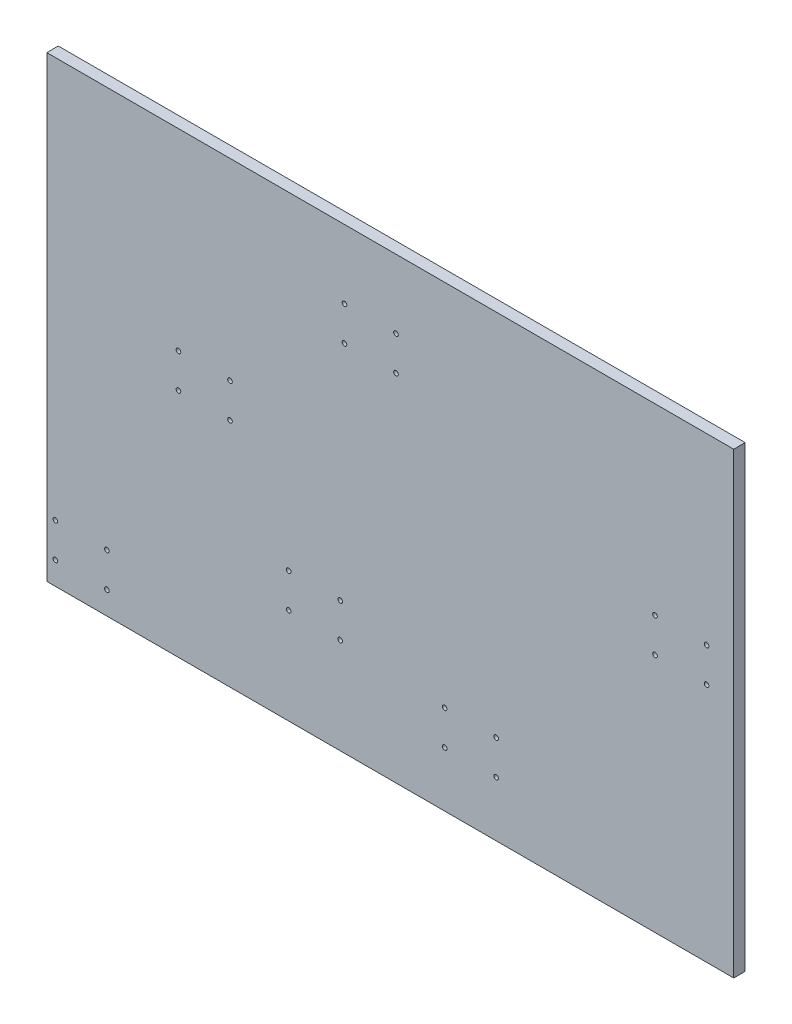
ISO-10303-21;
HEADER;
FILE_DESCRIPTION(('STEP AP214'),'2;1');
FILE_NAME('part.step','',(''),(''),'','','');
FILE_SCHEMA(('AUTOMOTIVE_DESIGN { 1 0 10303 214 1 1 1 1 }'));
ENDSEC;
DATA;
#1=APPLICATION_CONTEXT('core data for automotive mechanical design processes');
#2=APPLICATION_PROTOCOL_DEFINITION('international standard','automotive_design',2000,#1);
#3=PRODUCT_CONTEXT('',#1,'mechanical');
#4=PRODUCT('Part','Part','',(#3));
#5=PRODUCT_RELATED_PRODUCT_CATEGORY('part','',(#4));
#6=PRODUCT_DEFINITION_FORMATION('','',#4);
#7=PRODUCT_DEFINITION_CONTEXT('part definition',#1,'design');
#8=PRODUCT_DEFINITION('design','',#6,#7);
#9=PRODUCT_DEFINITION_SHAPE('','',#8);
#10=(LENGTH_UNIT() NAMED_UNIT(*) SI_UNIT(.MILLI.,.METRE.));
#11=(NAMED_UNIT(*) PLANE_ANGLE_UNIT() SI_UNIT($,.RADIAN.));
#12=(NAMED_UNIT(*) SI_UNIT($,.STERADIAN.) SOLID_ANGLE_UNIT());
#13=UNCERTAINTY_MEASURE_WITH_UNIT(LENGTH_MEASURE(1.E-05),#10,'distance_accuracy_value','');
#14=(GEOMETRIC_REPRESENTATION_CONTEXT(3) GLOBAL_UNCERTAINTY_ASSIGNED_CONTEXT((#13)) GLOBAL_UNIT_ASSIGNED_CONTEXT((#10,
#11,#12)) REPRESENTATION_CONTEXT('',''));
#15=CARTESIAN_POINT('',(0.,0.,0.));
#16=DIRECTION('',(0.,0.,1.));
#17=DIRECTION('',(1.,0.,0.));
#18=AXIS2_PLACEMENT_3D('',#15,#16,#17);
#19=CARTESIAN_POINT('',(0.,508.,0.));
#20=DIRECTION('',(0.,0.,-1.));
#21=DIRECTION('',(-1.,0.,0.));
#22=AXIS2_PLACEMENT_3D('',#19,#20,#21);
#23=PLANE('',#22);
#24=CARTESIAN_POINT('',(203.2,256.38125,0.));
#25=DIRECTION('',(0.,0.,1.));
#26=DIRECTION('',(1.,0.,0.));
#27=AXIS2_PLACEMENT_3D('',#24,#25,#26);
#28=CIRCLE('',#27,2.55269999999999);
#29=CARTESIAN_POINT('',(205.7527,256.38125,0.));
#30=VERTEX_POINT('',#29);
#31=EDGE_CURVE('E240',#30,#30,#28,.T.);
#32=ORIENTED_EDGE('',*,*,#31,.T.);
#33=EDGE_LOOP('',(#32));
#34=FACE_BOUND('',#33,.T.);
#35=CARTESIAN_POINT('',(146.05,294.48125,0.));
#36=DIRECTION('',(0.,0.,1.));
#37=DIRECTION('',(1.,0.,0.));
#38=AXIS2_PLACEMENT_3D('',#35,#36,#37);
#39=CIRCLE('',#38,2.55269999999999);
#40=CARTESIAN_POINT('',(148.6027,294.48125,0.));
#41=VERTEX_POINT('',#40);
#42=EDGE_CURVE('E228',#41,#41,#39,.T.);
#43=ORIENTED_EDGE('',*,*,#42,.T.);
#44=EDGE_LOOP('',(#43));
#45=FACE_BOUND('',#44,.T.);
#46=CARTESIAN_POINT('',(387.35,393.7,0.));
#47=DIRECTION('',(0.,0.,1.));
#48=DIRECTION('',(1.,0.,0.));
#49=AXIS2_PLACEMENT_3D('',#46,#47,#48);
#50=CIRCLE('',#49,2.55270000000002);
#51=CARTESIAN_POINT('',(389.9027,393.7,0.));
#52=VERTEX_POINT('',#51);
#53=EDGE_CURVE('E216',#52,#52,#50,.T.);
#54=ORIENTED_EDGE('',*,*,#53,.T.);
#55=EDGE_LOOP('',(#54));
#56=FACE_BOUND('',#55,.T.);
#57=CARTESIAN_POINT('',(330.2,431.8,0.));
#58=DIRECTION('',(0.,0.,1.));
#59=DIRECTION('',(1.,0.,0.));
#60=AXIS2_PLACEMENT_3D('',#57,#58,#59);
#61=CIRCLE('',#60,2.55270000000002);
#62=CARTESIAN_POINT('',(332.7527,431.8,0.));
#63=VERTEX_POINT('',#62);
#64=EDGE_CURVE('E204',#63,#63,#61,.T.);
#65=ORIENTED_EDGE('',*,*,#64,.T.);
#66=EDGE_LOOP('',(#65));
#67=FACE_BOUND('',#66,.T.);
#68=CARTESIAN_POINT('',(731.8375,266.7,0.));
#69=DIRECTION('',(0.,0.,1.));
#70=DIRECTION('',(1.,0.,0.));
#71=AXIS2_PLACEMENT_3D('',#68,#69,#70);
#72=CIRCLE('',#71,2.55269999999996);
#73=CARTESIAN_POINT('',(734.3902,266.7,0.));
#74=VERTEX_POINT('',#73);
#75=EDGE_CURVE('E192',#74,#74,#72,.T.);
#76=ORIENTED_EDGE('',*,*,#75,.T.);
#77=EDGE_LOOP('',(#76));
#78=FACE_BOUND('',#77,.T.);
#79=CARTESIAN_POINT('',(674.6875,304.8,0.));
#80=DIRECTION('',(0.,0.,1.));
#81=DIRECTION('',(1.,0.,0.));
#82=AXIS2_PLACEMENT_3D('',#79,#80,#81);
#83=CIRCLE('',#82,2.55269999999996);
#84=CARTESIAN_POINT('',(677.2402,304.8,0.));
#85=VERTEX_POINT('',#84);
#86=EDGE_CURVE('E180',#85,#85,#83,.T.);
#87=ORIENTED_EDGE('',*,*,#86,.T.);
#88=EDGE_LOOP('',(#87));
#89=FACE_BOUND('',#88,.T.);
#90=CARTESIAN_POINT('',(498.475,61.11875,0.));
#91=DIRECTION('',(0.,0.,1.));
#92=DIRECTION('',(1.,0.,0.));
#93=AXIS2_PLACEMENT_3D('',#90,#91,#92);
#94=CIRCLE('',#93,2.55270000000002);
#95=CARTESIAN_POINT('',(501.0277,61.11875,0.));
#96=VERTEX_POINT('',#95);
#97=EDGE_CURVE('E168',#96,#96,#94,.T.);
#98=ORIENTED_EDGE('',*,*,#97,.T.);
#99=EDGE_LOOP('',(#98));
#100=FACE_BOUND('',#99,.T.);
#101=CARTESIAN_POINT('',(268.2875,106.3625,0.));
#102=DIRECTION('',(0.,0.,1.));
#103=DIRECTION('',(1.,0.,0.));
#104=AXIS2_PLACEMENT_3D('',#101,#102,#103);
#105=CIRCLE('',#104,2.55270000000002);
#106=CARTESIAN_POINT('',(270.8402,106.3625,0.));
#107=VERTEX_POINT('',#106);
#108=EDGE_CURVE('E150',#107,#107,#105,.T.);
#109=ORIENTED_EDGE('',*,*,#108,.T.);
#110=EDGE_LOOP('',(#109));
#111=FACE_BOUND('',#110,.T.);
#112=CARTESIAN_POINT('',(325.4375,144.4625,0.));
#113=DIRECTION('',(0.,0.,1.));
#114=DIRECTION('',(1.,0.,0.));
#115=AXIS2_PLACEMENT_3D('',#112,#113,#114);
#116=CIRCLE('',#115,2.55270000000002);
#117=CARTESIAN_POINT('',(327.9902,144.4625,0.));
#118=VERTEX_POINT('',#117);
#119=EDGE_CURVE('E138',#118,#118,#116,.T.);
#120=ORIENTED_EDGE('',*,*,#119,.T.);
#121=EDGE_LOOP('',(#120));
#122=FACE_BOUND('',#121,.T.);
#123=CARTESIAN_POINT('',(268.2875,144.4625,0.));
#124=DIRECTION('',(0.,0.,1.));
#125=DIRECTION('',(1.,0.,0.));
#126=AXIS2_PLACEMENT_3D('',#123,#124,#125);
#127=CIRCLE('',#126,2.55270000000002);
#128=CARTESIAN_POINT('',(270.8402,144.4625,0.));
#129=VERTEX_POINT('',#128);
#130=EDGE_CURVE('E132',#129,#129,#127,.T.);
#131=ORIENTED_EDGE('',*,*,#130,.T.);
#132=EDGE_LOOP('',(#131));
#133=FACE_BOUND('',#132,.T.);
#134=CARTESIAN_POINT('',(9.52500000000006,25.4,0.));
#135=DIRECTION('',(0.,0.,1.));
#136=DIRECTION('',(1.,0.,0.));
#137=AXIS2_PLACEMENT_3D('',#134,#135,#136);
#138=CIRCLE('',#137,2.5527);
#139=CARTESIAN_POINT('',(12.0777000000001,25.4,0.));
#140=VERTEX_POINT('',#139);
#141=EDGE_CURVE('E126',#140,#140,#138,.T.);
#142=ORIENTED_EDGE('',*,*,#141,.T.);
#143=EDGE_LOOP('',(#142));
#144=FACE_BOUND('',#143,.T.);
#145=CARTESIAN_POINT('',(66.6750000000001,25.4,0.));
#146=DIRECTION('',(0.,0.,1.));
#147=DIRECTION('',(1.,0.,0.));
#148=AXIS2_PLACEMENT_3D('',#145,#146,#147);
#149=CIRCLE('',#148,2.55269999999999);
#150=CARTESIAN_POINT('',(69.2277,25.4,0.));
#151=VERTEX_POINT('',#150);
#152=EDGE_CURVE('E120',#151,#151,#149,.T.);
#153=ORIENTED_EDGE('',*,*,#152,.T.);
#154=EDGE_LOOP('',(#153));
#155=FACE_BOUND('',#154,.T.);
#156=CARTESIAN_POINT('',(66.6750000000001,63.5,0.));
#157=DIRECTION('',(0.,0.,1.));
#158=DIRECTION('',(1.,0.,0.));
#159=AXIS2_PLACEMENT_3D('',#156,#157,#158);
#160=CIRCLE('',#159,2.55269999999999);
#161=CARTESIAN_POINT('',(69.2277,63.5,0.));
#162=VERTEX_POINT('',#161);
#163=EDGE_CURVE('E114',#162,#162,#160,.T.);
#164=ORIENTED_EDGE('',*,*,#163,.T.);
#165=EDGE_LOOP('',(#164));
#166=FACE_BOUND('',#165,.T.);
#167=DIRECTION('',(0.,-1.,0.));
#168=VECTOR('',#167,1.);
#169=CARTESIAN_POINT('',(0.,0.,0.));
#170=LINE('',#169,#168);
#171=CARTESIAN_POINT('',(0.,508.,0.));
#172=VERTEX_POINT('',#171);
#173=CARTESIAN_POINT('',(0.,0.,0.));
#174=VERTEX_POINT('',#173);
#175=EDGE_CURVE('E95',#172,#174,#170,.T.);
#176=ORIENTED_EDGE('',*,*,#175,.F.);
#177=DIRECTION('',(-1.,0.,0.));
#178=VECTOR('',#177,1.);
#179=CARTESIAN_POINT('',(0.,508.,0.));
#180=LINE('',#179,#178);
#181=CARTESIAN_POINT('',(762.,508.,0.));
#182=VERTEX_POINT('',#181);
#183=EDGE_CURVE('E70',#182,#172,#180,.T.);
#184=ORIENTED_EDGE('',*,*,#183,.F.);
#185=DIRECTION('',(0.,1.,0.));
#186=VECTOR('',#185,1.);
#187=CARTESIAN_POINT('',(762.,0.,0.));
#188=LINE('',#187,#186);
#189=CARTESIAN_POINT('',(762.,0.,0.));
#190=VERTEX_POINT('',#189);
#191=EDGE_CURVE('E64',#190,#182,#188,.T.);
#192=ORIENTED_EDGE('',*,*,#191,.F.);
#193=DIRECTION('',(1.,0.,0.));
#194=VECTOR('',#193,1.);
#195=CARTESIAN_POINT('',(0.,0.,0.));
#196=LINE('',#195,#194);
#197=EDGE_CURVE('E87',#174,#190,#196,.T.);
#198=ORIENTED_EDGE('',*,*,#197,.F.);
#199=EDGE_LOOP('',(#176,#184,#192,#198));
#200=FACE_BOUND('',#199,.T.);
#201=CARTESIAN_POINT('',(9.52500000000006,63.5,0.));
#202=DIRECTION('',(0.,0.,1.));
#203=DIRECTION('',(1.,0.,0.));
#204=AXIS2_PLACEMENT_3D('',#201,#202,#203);
#205=CIRCLE('',#204,2.5527);
#206=CARTESIAN_POINT('',(12.0777000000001,63.5,0.));
#207=VERTEX_POINT('',#206);
#208=EDGE_CURVE('E98',#207,#207,#205,.T.);
#209=ORIENTED_EDGE('',*,*,#208,.T.);
#210=EDGE_LOOP('',(#209));
#211=FACE_BOUND('',#210,.T.);
#212=CARTESIAN_POINT('',(325.4375,106.3625,0.));
#213=DIRECTION('',(0.,0.,1.));
#214=DIRECTION('',(1.,0.,0.));
#215=AXIS2_PLACEMENT_3D('',#212,#213,#214);
#216=CIRCLE('',#215,2.55270000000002);
#217=CARTESIAN_POINT('',(327.9902,106.3625,0.));
#218=VERTEX_POINT('',#217);
#219=EDGE_CURVE('E144',#218,#218,#216,.T.);
#220=ORIENTED_EDGE('',*,*,#219,.T.);
#221=EDGE_LOOP('',(#220));
#222=FACE_BOUND('',#221,.T.);
#223=CARTESIAN_POINT('',(441.325,99.21875,0.));
#224=DIRECTION('',(0.,0.,1.));
#225=DIRECTION('',(1.,0.,0.));
#226=AXIS2_PLACEMENT_3D('',#223,#224,#225);
#227=CIRCLE('',#226,2.55270000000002);
#228=CARTESIAN_POINT('',(443.8777,99.21875,0.));
#229=VERTEX_POINT('',#228);
#230=EDGE_CURVE('E156',#229,#229,#227,.T.);
#231=ORIENTED_EDGE('',*,*,#230,.T.);
#232=EDGE_LOOP('',(#231));
#233=FACE_BOUND('',#232,.T.);
#234=CARTESIAN_POINT('',(498.475,99.21875,0.));
#235=DIRECTION('',(0.,0.,1.));
#236=DIRECTION('',(1.,0.,0.));
#237=AXIS2_PLACEMENT_3D('',#234,#235,#236);
#238=CIRCLE('',#237,2.55270000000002);
#239=CARTESIAN_POINT('',(501.0277,99.21875,0.));
#240=VERTEX_POINT('',#239);
#241=EDGE_CURVE('E162',#240,#240,#238,.T.);
#242=ORIENTED_EDGE('',*,*,#241,.T.);
#243=EDGE_LOOP('',(#242));
#244=FACE_BOUND('',#243,.T.);
#245=CARTESIAN_POINT('',(441.325,61.11875,0.));
#246=DIRECTION('',(0.,0.,1.));
#247=DIRECTION('',(1.,0.,0.));
#248=AXIS2_PLACEMENT_3D('',#245,#246,#247);
#249=CIRCLE('',#248,2.55270000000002);
#250=CARTESIAN_POINT('',(443.8777,61.11875,0.));
#251=VERTEX_POINT('',#250);
#252=EDGE_CURVE('E174',#251,#251,#249,.T.);
#253=ORIENTED_EDGE('',*,*,#252,.T.);
#254=EDGE_LOOP('',(#253));
#255=FACE_BOUND('',#254,.T.);
#256=CARTESIAN_POINT('',(731.8375,304.8,0.));
#257=DIRECTION('',(0.,0.,1.));
#258=DIRECTION('',(1.,0.,0.));
#259=AXIS2_PLACEMENT_3D('',#256,#257,#258);
#260=CIRCLE('',#259,2.55269999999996);
#261=CARTESIAN_POINT('',(734.3902,304.8,0.));
#262=VERTEX_POINT('',#261);
#263=EDGE_CURVE('E186',#262,#262,#260,.T.);
#264=ORIENTED_EDGE('',*,*,#263,.T.);
#265=EDGE_LOOP('',(#264));
#266=FACE_BOUND('',#265,.T.);
#267=CARTESIAN_POINT('',(674.6875,266.7,0.));
#268=DIRECTION('',(0.,0.,1.));
#269=DIRECTION('',(1.,0.,0.));
#270=AXIS2_PLACEMENT_3D('',#267,#268,#269);
#271=CIRCLE('',#270,2.55269999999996);
#272=CARTESIAN_POINT('',(677.2402,266.7,0.));
#273=VERTEX_POINT('',#272);
#274=EDGE_CURVE('E198',#273,#273,#271,.T.);
#275=ORIENTED_EDGE('',*,*,#274,.T.);
#276=EDGE_LOOP('',(#275));
#277=FACE_BOUND('',#276,.T.);
#278=CARTESIAN_POINT('',(387.35,431.8,0.));
#279=DIRECTION('',(0.,0.,1.));
#280=DIRECTION('',(1.,0.,0.));
#281=AXIS2_PLACEMENT_3D('',#278,#279,#280);
#282=CIRCLE('',#281,2.55270000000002);
#283=CARTESIAN_POINT('',(389.9027,431.8,0.));
#284=VERTEX_POINT('',#283);
#285=EDGE_CURVE('E210',#284,#284,#282,.T.);
#286=ORIENTED_EDGE('',*,*,#285,.T.);
#287=EDGE_LOOP('',(#286));
#288=FACE_BOUND('',#287,.T.);
#289=CARTESIAN_POINT('',(330.2,393.7,0.));
#290=DIRECTION('',(0.,0.,1.));
#291=DIRECTION('',(1.,0.,0.));
#292=AXIS2_PLACEMENT_3D('',#289,#290,#291);
#293=CIRCLE('',#292,2.55270000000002);
#294=CARTESIAN_POINT('',(332.7527,393.7,0.));
#295=VERTEX_POINT('',#294);
#296=EDGE_CURVE('E222',#295,#295,#293,.T.);
#297=ORIENTED_EDGE('',*,*,#296,.T.);
#298=EDGE_LOOP('',(#297));
#299=FACE_BOUND('',#298,.T.);
#300=CARTESIAN_POINT('',(203.2,294.48125,0.));
#301=DIRECTION('',(0.,0.,1.));
#302=DIRECTION('',(1.,0.,0.));
#303=AXIS2_PLACEMENT_3D('',#300,#301,#302);
#304=CIRCLE('',#303,2.55269999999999);
#305=CARTESIAN_POINT('',(205.7527,294.48125,0.));
#306=VERTEX_POINT('',#305);
#307=EDGE_CURVE('E234',#306,#306,#304,.T.);
#308=ORIENTED_EDGE('',*,*,#307,.T.);
#309=EDGE_LOOP('',(#308));
#310=FACE_BOUND('',#309,.T.);
#311=CARTESIAN_POINT('',(146.05,256.38125,0.));
#312=DIRECTION('',(0.,0.,1.));
#313=DIRECTION('',(1.,0.,0.));
#314=AXIS2_PLACEMENT_3D('',#311,#312,#313);
#315=CIRCLE('',#314,2.55269999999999);
#316=CARTESIAN_POINT('',(148.6027,256.38125,0.));
#317=VERTEX_POINT('',#316);
#318=EDGE_CURVE('E246',#317,#317,#315,.T.);
#319=ORIENTED_EDGE('',*,*,#318,.T.);
#320=EDGE_LOOP('',(#319));
#321=FACE_BOUND('',#320,.T.);
#322=ADVANCED_FACE('F30',(#34,#45,#56,#67,#78,#89,#100,#111,#122,#133,#144,#155,#166,#200,#211,
#222,#233,#244,#255,#266,#277,#288,#299,#310,#321),#23,.T.);
#323=CARTESIAN_POINT('',(0.,508.,12.7));
#324=DIRECTION('',(0.,0.,-1.));
#325=DIRECTION('',(-1.,0.,0.));
#326=AXIS2_PLACEMENT_3D('',#323,#324,#325);
#327=PLANE('',#326);
#328=CARTESIAN_POINT('',(203.2,256.38125,12.7));
#329=DIRECTION('',(0.,0.,1.));
#330=DIRECTION('',(1.,0.,0.));
#331=AXIS2_PLACEMENT_3D('',#328,#329,#330);
#332=CIRCLE('',#331,2.55269999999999);
#333=CARTESIAN_POINT('',(205.7527,256.38125,12.7));
#334=VERTEX_POINT('',#333);
#335=EDGE_CURVE('E243',#334,#334,#332,.T.);
#336=ORIENTED_EDGE('',*,*,#335,.F.);
#337=EDGE_LOOP('',(#336));
#338=FACE_BOUND('',#337,.T.);
#339=CARTESIAN_POINT('',(146.05,294.48125,12.7));
#340=DIRECTION('',(0.,0.,1.));
#341=DIRECTION('',(1.,0.,0.));
#342=AXIS2_PLACEMENT_3D('',#339,#340,#341);
#343=CIRCLE('',#342,2.55269999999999);
#344=CARTESIAN_POINT('',(148.6027,294.48125,12.7));
#345=VERTEX_POINT('',#344);
#346=EDGE_CURVE('E231',#345,#345,#343,.T.);
#347=ORIENTED_EDGE('',*,*,#346,.F.);
#348=EDGE_LOOP('',(#347));
#349=FACE_BOUND('',#348,.T.);
#350=CARTESIAN_POINT('',(387.35,393.7,12.7));
#351=DIRECTION('',(0.,0.,1.));
#352=DIRECTION('',(1.,0.,0.));
#353=AXIS2_PLACEMENT_3D('',#350,#351,#352);
#354=CIRCLE('',#353,2.55269999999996);
#355=CARTESIAN_POINT('',(389.9027,393.7,12.7));
#356=VERTEX_POINT('',#355);
#357=EDGE_CURVE('E219',#356,#356,#354,.T.);
#358=ORIENTED_EDGE('',*,*,#357,.F.);
#359=EDGE_LOOP('',(#358));
#360=FACE_BOUND('',#359,.T.);
#361=CARTESIAN_POINT('',(330.2,431.8,12.7));
#362=DIRECTION('',(0.,0.,1.));
#363=DIRECTION('',(1.,0.,0.));
#364=AXIS2_PLACEMENT_3D('',#361,#362,#363);
#365=CIRCLE('',#364,2.55269999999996);
#366=CARTESIAN_POINT('',(332.7527,431.8,12.7));
#367=VERTEX_POINT('',#366);
#368=EDGE_CURVE('E207',#367,#367,#365,.T.);
#369=ORIENTED_EDGE('',*,*,#368,.F.);
#370=EDGE_LOOP('',(#369));
#371=FACE_BOUND('',#370,.T.);
#372=CARTESIAN_POINT('',(731.8375,266.7,12.7));
#373=DIRECTION('',(0.,0.,1.));
#374=DIRECTION('',(1.,0.,0.));
#375=AXIS2_PLACEMENT_3D('',#372,#373,#374);
#376=CIRCLE('',#375,2.55269999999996);
#377=CARTESIAN_POINT('',(734.3902,266.7,12.7));
#378=VERTEX_POINT('',#377);
#379=EDGE_CURVE('E195',#378,#378,#376,.T.);
#380=ORIENTED_EDGE('',*,*,#379,.F.);
#381=EDGE_LOOP('',(#380));
#382=FACE_BOUND('',#381,.T.);
#383=CARTESIAN_POINT('',(441.325,61.11875,12.7));
#384=DIRECTION('',(0.,0.,1.));
#385=DIRECTION('',(1.,0.,0.));
#386=AXIS2_PLACEMENT_3D('',#383,#384,#385);
#387=CIRCLE('',#386,2.55269999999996);
#388=CARTESIAN_POINT('',(443.8777,61.11875,12.7));
#389=VERTEX_POINT('',#388);
#390=EDGE_CURVE('E177',#389,#389,#387,.T.);
#391=ORIENTED_EDGE('',*,*,#390,.F.);
#392=EDGE_LOOP('',(#391));
#393=FACE_BOUND('',#392,.T.);
#394=CARTESIAN_POINT('',(498.475,99.21875,12.7));
#395=DIRECTION('',(0.,0.,1.));
#396=DIRECTION('',(1.,0.,0.));
#397=AXIS2_PLACEMENT_3D('',#394,#395,#396);
#398=CIRCLE('',#397,2.55270000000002);
#399=CARTESIAN_POINT('',(501.0277,99.21875,12.7));
#400=VERTEX_POINT('',#399);
#401=EDGE_CURVE('E165',#400,#400,#398,.T.);
#402=ORIENTED_EDGE('',*,*,#401,.F.);
#403=EDGE_LOOP('',(#402));
#404=FACE_BOUND('',#403,.T.);
#405=CARTESIAN_POINT('',(268.2875,106.3625,12.7));
#406=DIRECTION('',(0.,0.,1.));
#407=DIRECTION('',(1.,0.,0.));
#408=AXIS2_PLACEMENT_3D('',#405,#406,#407);
#409=CIRCLE('',#408,2.55269999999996);
#410=CARTESIAN_POINT('',(270.8402,106.3625,12.7));
#411=VERTEX_POINT('',#410);
#412=EDGE_CURVE('E153',#411,#411,#409,.T.);
#413=ORIENTED_EDGE('',*,*,#412,.F.);
#414=EDGE_LOOP('',(#413));
#415=FACE_BOUND('',#414,.T.);
#416=CARTESIAN_POINT('',(325.4375,144.4625,12.7));
#417=DIRECTION('',(0.,0.,1.));
#418=DIRECTION('',(1.,0.,0.));
#419=AXIS2_PLACEMENT_3D('',#416,#417,#418);
#420=CIRCLE('',#419,2.55269999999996);
#421=CARTESIAN_POINT('',(327.9902,144.4625,12.7));
#422=VERTEX_POINT('',#421);
#423=EDGE_CURVE('E141',#422,#422,#420,.T.);
#424=ORIENTED_EDGE('',*,*,#423,.F.);
#425=EDGE_LOOP('',(#424));
#426=FACE_BOUND('',#425,.T.);
#427=CARTESIAN_POINT('',(268.2875,144.4625,12.7));
#428=DIRECTION('',(0.,0.,1.));
#429=DIRECTION('',(1.,0.,0.));
#430=AXIS2_PLACEMENT_3D('',#427,#428,#429);
#431=CIRCLE('',#430,2.55269999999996);
#432=CARTESIAN_POINT('',(270.8402,144.4625,12.7));
#433=VERTEX_POINT('',#432);
#434=EDGE_CURVE('E135',#433,#433,#431,.T.);
#435=ORIENTED_EDGE('',*,*,#434,.F.);
#436=EDGE_LOOP('',(#435));
#437=FACE_BOUND('',#436,.T.);
#438=CARTESIAN_POINT('',(9.52500000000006,25.4,12.7));
#439=DIRECTION('',(0.,0.,1.));
#440=DIRECTION('',(1.,0.,0.));
#441=AXIS2_PLACEMENT_3D('',#438,#439,#440);
#442=CIRCLE('',#441,2.55269999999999);
#443=CARTESIAN_POINT('',(12.0777,25.4,12.7));
#444=VERTEX_POINT('',#443);
#445=EDGE_CURVE('E129',#444,#444,#442,.T.);
#446=ORIENTED_EDGE('',*,*,#445,.F.);
#447=EDGE_LOOP('',(#446));
#448=FACE_BOUND('',#447,.T.);
#449=CARTESIAN_POINT('',(66.6750000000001,25.4,12.7));
#450=DIRECTION('',(0.,0.,1.));
#451=DIRECTION('',(1.,0.,0.));
#452=AXIS2_PLACEMENT_3D('',#449,#450,#451);
#453=CIRCLE('',#452,2.55269999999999);
#454=CARTESIAN_POINT('',(69.2277,25.4,12.7));
#455=VERTEX_POINT('',#454);
#456=EDGE_CURVE('E123',#455,#455,#453,.T.);
#457=ORIENTED_EDGE('',*,*,#456,.F.);
#458=EDGE_LOOP('',(#457));
#459=FACE_BOUND('',#458,.T.);
#460=CARTESIAN_POINT('',(66.6750000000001,63.5,12.7));
#461=DIRECTION('',(0.,0.,1.));
#462=DIRECTION('',(1.,0.,0.));
#463=AXIS2_PLACEMENT_3D('',#460,#461,#462);
#464=CIRCLE('',#463,2.55269999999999);
#465=CARTESIAN_POINT('',(69.2277,63.5,12.7));
#466=VERTEX_POINT('',#465);
#467=EDGE_CURVE('E117',#466,#466,#464,.T.);
#468=ORIENTED_EDGE('',*,*,#467,.F.);
#469=EDGE_LOOP('',(#468));
#470=FACE_BOUND('',#469,.T.);
#471=CARTESIAN_POINT('',(9.52500000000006,63.5,12.7));
#472=DIRECTION('',(0.,0.,1.));
#473=DIRECTION('',(1.,0.,0.));
#474=AXIS2_PLACEMENT_3D('',#471,#472,#473);
#475=CIRCLE('',#474,2.55269999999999);
#476=CARTESIAN_POINT('',(12.0777,63.5,12.7));
#477=VERTEX_POINT('',#476);
#478=EDGE_CURVE('E111',#477,#477,#475,.T.);
#479=ORIENTED_EDGE('',*,*,#478,.F.);
#480=EDGE_LOOP('',(#479));
#481=FACE_BOUND('',#480,.T.);
#482=DIRECTION('',(0.,-1.,0.));
#483=VECTOR('',#482,1.);
#484=CARTESIAN_POINT('',(0.,0.,12.7));
#485=LINE('',#484,#483);
#486=CARTESIAN_POINT('',(0.,508.,12.7));
#487=VERTEX_POINT('',#486);
#488=CARTESIAN_POINT('',(0.,0.,12.7));
#489=VERTEX_POINT('',#488);
#490=EDGE_CURVE('E83',#487,#489,#485,.T.);
#491=ORIENTED_EDGE('',*,*,#490,.T.);
#492=DIRECTION('',(1.,0.,0.));
#493=VECTOR('',#492,1.);
#494=CARTESIAN_POINT('',(0.,0.,12.7));
#495=LINE('',#494,#493);
#496=CARTESIAN_POINT('',(762.,0.,12.7));
#497=VERTEX_POINT('',#496);
#498=EDGE_CURVE('E77',#489,#497,#495,.T.);
#499=ORIENTED_EDGE('',*,*,#498,.T.);
#500=DIRECTION('',(0.,1.,0.));
#501=VECTOR('',#500,1.);
#502=CARTESIAN_POINT('',(762.,0.,12.7));
#503=LINE('',#502,#501);
#504=CARTESIAN_POINT('',(762.,508.,12.7));
#505=VERTEX_POINT('',#504);
#506=EDGE_CURVE('E81',#497,#505,#503,.T.);
#507=ORIENTED_EDGE('',*,*,#506,.T.);
#508=DIRECTION('',(-1.,0.,0.));
#509=VECTOR('',#508,1.);
#510=CARTESIAN_POINT('',(0.,508.,12.7));
#511=LINE('',#510,#509);
#512=EDGE_CURVE('E47',#505,#487,#511,.T.);
#513=ORIENTED_EDGE('',*,*,#512,.T.);
#514=EDGE_LOOP('',(#491,#499,#507,#513));
#515=FACE_BOUND('',#514,.T.);
#516=CARTESIAN_POINT('',(325.4375,106.3625,12.7));
#517=DIRECTION('',(0.,0.,1.));
#518=DIRECTION('',(1.,0.,0.));
#519=AXIS2_PLACEMENT_3D('',#516,#517,#518);
#520=CIRCLE('',#519,2.55269999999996);
#521=CARTESIAN_POINT('',(327.9902,106.3625,12.7));
#522=VERTEX_POINT('',#521);
#523=EDGE_CURVE('E147',#522,#522,#520,.T.);
#524=ORIENTED_EDGE('',*,*,#523,.F.);
#525=EDGE_LOOP('',(#524));
#526=FACE_BOUND('',#525,.T.);
#527=CARTESIAN_POINT('',(441.325,99.21875,12.7));
#528=DIRECTION('',(0.,0.,1.));
#529=DIRECTION('',(1.,0.,0.));
#530=AXIS2_PLACEMENT_3D('',#527,#528,#529);
#531=CIRCLE('',#530,2.55269999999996);
#532=CARTESIAN_POINT('',(443.8777,99.21875,12.7));
#533=VERTEX_POINT('',#532);
#534=EDGE_CURVE('E159',#533,#533,#531,.T.);
#535=ORIENTED_EDGE('',*,*,#534,.F.);
#536=EDGE_LOOP('',(#535));
#537=FACE_BOUND('',#536,.T.);
#538=CARTESIAN_POINT('',(498.475,61.11875,12.7));
#539=DIRECTION('',(0.,0.,1.));
#540=DIRECTION('',(1.,0.,0.));
#541=AXIS2_PLACEMENT_3D('',#538,#539,#540);
#542=CIRCLE('',#541,2.55270000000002);
#543=CARTESIAN_POINT('',(501.0277,61.11875,12.7));
#544=VERTEX_POINT('',#543);
#545=EDGE_CURVE('E171',#544,#544,#542,.T.);
#546=ORIENTED_EDGE('',*,*,#545,.F.);
#547=EDGE_LOOP('',(#546));
#548=FACE_BOUND('',#547,.T.);
#549=CARTESIAN_POINT('',(674.6875,304.8,12.7));
#550=DIRECTION('',(0.,0.,1.));
#551=DIRECTION('',(1.,0.,0.));
#552=AXIS2_PLACEMENT_3D('',#549,#550,#551);
#553=CIRCLE('',#552,2.55269999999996);
#554=CARTESIAN_POINT('',(677.2402,304.8,12.7));
#555=VERTEX_POINT('',#554);
#556=EDGE_CURVE('E183',#555,#555,#553,.T.);
#557=ORIENTED_EDGE('',*,*,#556,.F.);
#558=EDGE_LOOP('',(#557));
#559=FACE_BOUND('',#558,.T.);
#560=CARTESIAN_POINT('',(731.8375,304.8,12.7));
#561=DIRECTION('',(0.,0.,1.));
#562=DIRECTION('',(1.,0.,0.));
#563=AXIS2_PLACEMENT_3D('',#560,#561,#562);
#564=CIRCLE('',#563,2.55269999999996);
#565=CARTESIAN_POINT('',(734.3902,304.8,12.7));
#566=VERTEX_POINT('',#565);
#567=EDGE_CURVE('E189',#566,#566,#564,.T.);
#568=ORIENTED_EDGE('',*,*,#567,.F.);
#569=EDGE_LOOP('',(#568));
#570=FACE_BOUND('',#569,.T.);
#571=CARTESIAN_POINT('',(674.6875,266.7,12.7));
#572=DIRECTION('',(0.,0.,1.));
#573=DIRECTION('',(1.,0.,0.));
#574=AXIS2_PLACEMENT_3D('',#571,#572,#573);
#575=CIRCLE('',#574,2.55269999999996);
#576=CARTESIAN_POINT('',(677.2402,266.7,12.7));
#577=VERTEX_POINT('',#576);
#578=EDGE_CURVE('E201',#577,#577,#575,.T.);
#579=ORIENTED_EDGE('',*,*,#578,.F.);
#580=EDGE_LOOP('',(#579));
#581=FACE_BOUND('',#580,.T.);
#582=CARTESIAN_POINT('',(387.35,431.8,12.7));
#583=DIRECTION('',(0.,0.,1.));
#584=DIRECTION('',(1.,0.,0.));
#585=AXIS2_PLACEMENT_3D('',#582,#583,#584);
#586=CIRCLE('',#585,2.55269999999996);
#587=CARTESIAN_POINT('',(389.9027,431.8,12.7));
#588=VERTEX_POINT('',#587);
#589=EDGE_CURVE('E213',#588,#588,#586,.T.);
#590=ORIENTED_EDGE('',*,*,#589,.F.);
#591=EDGE_LOOP('',(#590));
#592=FACE_BOUND('',#591,.T.);
#593=CARTESIAN_POINT('',(330.2,393.7,12.7));
#594=DIRECTION('',(0.,0.,1.));
#595=DIRECTION('',(1.,0.,0.));
#596=AXIS2_PLACEMENT_3D('',#593,#594,#595);
#597=CIRCLE('',#596,2.55269999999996);
#598=CARTESIAN_POINT('',(332.7527,393.7,12.7));
#599=VERTEX_POINT('',#598);
#600=EDGE_CURVE('E225',#599,#599,#597,.T.);
#601=ORIENTED_EDGE('',*,*,#600,.F.);
#602=EDGE_LOOP('',(#601));
#603=FACE_BOUND('',#602,.T.);
#604=CARTESIAN_POINT('',(203.2,294.48125,12.7));
#605=DIRECTION('',(0.,0.,1.));
#606=DIRECTION('',(1.,0.,0.));
#607=AXIS2_PLACEMENT_3D('',#604,#605,#606);
#608=CIRCLE('',#607,2.55269999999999);
#609=CARTESIAN_POINT('',(205.7527,294.48125,12.7));
#610=VERTEX_POINT('',#609);
#611=EDGE_CURVE('E237',#610,#610,#608,.T.);
#612=ORIENTED_EDGE('',*,*,#611,.F.);
#613=EDGE_LOOP('',(#612));
#614=FACE_BOUND('',#613,.T.);
#615=CARTESIAN_POINT('',(146.05,256.38125,12.7));
#616=DIRECTION('',(0.,0.,1.));
#617=DIRECTION('',(1.,0.,0.));
#618=AXIS2_PLACEMENT_3D('',#615,#616,#617);
#619=CIRCLE('',#618,2.55269999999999);
#620=CARTESIAN_POINT('',(148.6027,256.38125,12.7));
#621=VERTEX_POINT('',#620);
#622=EDGE_CURVE('E249',#621,#621,#619,.T.);
#623=ORIENTED_EDGE('',*,*,#622,.F.);
#624=EDGE_LOOP('',(#623));
#625=FACE_BOUND('',#624,.T.);
#626=ADVANCED_FACE('F78',(#338,#349,#360,#371,#382,#393,#404,#415,#426,#437,#448,#459,#470,#481,
#515,#526,#537,#548,#559,#570,#581,#592,#603,#614,#625),#327,.F.);
#627=CARTESIAN_POINT('',(0.,0.,12.7));
#628=DIRECTION('',(1.,0.,0.));
#629=DIRECTION('',(0.,0.,-1.));
#630=AXIS2_PLACEMENT_3D('',#627,#628,#629);
#631=PLANE('',#630);
#632=ORIENTED_EDGE('',*,*,#175,.T.);
#633=DIRECTION('',(0.,0.,-1.));
#634=VECTOR('',#633,1.);
#635=CARTESIAN_POINT('',(0.,0.,12.7));
#636=LINE('',#635,#634);
#637=EDGE_CURVE('E11',#489,#174,#636,.T.);
#638=ORIENTED_EDGE('',*,*,#637,.F.);
#639=ORIENTED_EDGE('',*,*,#490,.F.);
#640=DIRECTION('',(0.,0.,-1.));
#641=VECTOR('',#640,1.);
#642=CARTESIAN_POINT('',(0.,508.,12.7));
#643=LINE('',#642,#641);
#644=EDGE_CURVE('E91',#487,#172,#643,.T.);
#645=ORIENTED_EDGE('',*,*,#644,.T.);
#646=EDGE_LOOP('',(#632,#638,#639,#645));
#647=FACE_BOUND('',#646,.T.);
#648=ADVANCED_FACE('F32',(#647),#631,.F.);
#649=CARTESIAN_POINT('',(0.,0.,12.7));
#650=DIRECTION('',(0.,1.,0.));
#651=DIRECTION('',(0.,0.,1.));
#652=AXIS2_PLACEMENT_3D('',#649,#650,#651);
#653=PLANE('',#652);
#654=ORIENTED_EDGE('',*,*,#197,.T.);
#655=DIRECTION('',(0.,0.,-1.));
#656=VECTOR('',#655,1.);
#657=CARTESIAN_POINT('',(762.,0.,12.7));
#658=LINE('',#657,#656);
#659=EDGE_CURVE('E39',#497,#190,#658,.T.);
#660=ORIENTED_EDGE('',*,*,#659,.F.);
#661=ORIENTED_EDGE('',*,*,#498,.F.);
#662=ORIENTED_EDGE('',*,*,#637,.T.);
#663=EDGE_LOOP('',(#654,#660,#661,#662));
#664=FACE_BOUND('',#663,.T.);
#665=ADVANCED_FACE('F86',(#664),#653,.F.);
#666=CARTESIAN_POINT('',(762.,0.,12.7));
#667=DIRECTION('',(-1.,0.,0.));
#668=DIRECTION('',(0.,-1.,0.));
#669=AXIS2_PLACEMENT_3D('',#666,#667,#668);
#670=PLANE('',#669);
#671=ORIENTED_EDGE('',*,*,#191,.T.);
#672=DIRECTION('',(0.,0.,-1.));
#673=VECTOR('',#672,1.);
#674=CARTESIAN_POINT('',(762.,508.,12.7));
#675=LINE('',#674,#673);
#676=EDGE_CURVE('E88',#505,#182,#675,.T.);
#677=ORIENTED_EDGE('',*,*,#676,.F.);
#678=ORIENTED_EDGE('',*,*,#506,.F.);
#679=ORIENTED_EDGE('',*,*,#659,.T.);
#680=EDGE_LOOP('',(#671,#677,#678,#679));
#681=FACE_BOUND('',#680,.T.);
#682=ADVANCED_FACE('F89',(#681),#670,.F.);
#683=CARTESIAN_POINT('',(0.,508.,12.7));
#684=DIRECTION('',(0.,-1.,0.));
#685=DIRECTION('',(0.,0.,-1.));
#686=AXIS2_PLACEMENT_3D('',#683,#684,#685);
#687=PLANE('',#686);
#688=ORIENTED_EDGE('',*,*,#183,.T.);
#689=ORIENTED_EDGE('',*,*,#644,.F.);
#690=ORIENTED_EDGE('',*,*,#512,.F.);
#691=ORIENTED_EDGE('',*,*,#676,.T.);
#692=EDGE_LOOP('',(#688,#689,#690,#691));
#693=FACE_BOUND('',#692,.T.);
#694=ADVANCED_FACE('F103',(#693),#687,.F.);
#695=CARTESIAN_POINT('',(9.52500000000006,63.5,12.7));
#696=DIRECTION('',(0.,0.,1.));
#697=DIRECTION('',(1.,0.,0.));
#698=AXIS2_PLACEMENT_3D('',#695,#696,#697);
#699=CYLINDRICAL_SURFACE('',#698,2.55269999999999);
#700=ORIENTED_EDGE('',*,*,#208,.F.);
#701=EDGE_LOOP('',(#700));
#702=FACE_BOUND('',#701,.T.);
#703=ORIENTED_EDGE('',*,*,#478,.T.);
#704=EDGE_LOOP('',(#703));
#705=FACE_BOUND('',#704,.T.);
#706=ADVANCED_FACE('F267',(#702,#705),#699,.F.);
#707=CARTESIAN_POINT('',(66.6750000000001,63.5,12.7));
#708=DIRECTION('',(0.,0.,1.));
#709=DIRECTION('',(1.,0.,0.));
#710=AXIS2_PLACEMENT_3D('',#707,#708,#709);
#711=CYLINDRICAL_SURFACE('',#710,2.55269999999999);
#712=ORIENTED_EDGE('',*,*,#163,.F.);
#713=EDGE_LOOP('',(#712));
#714=FACE_BOUND('',#713,.T.);
#715=ORIENTED_EDGE('',*,*,#467,.T.);
#716=EDGE_LOOP('',(#715));
#717=FACE_BOUND('',#716,.T.);
#718=ADVANCED_FACE('F292',(#714,#717),#711,.F.);
#719=CARTESIAN_POINT('',(66.6750000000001,25.4,12.7));
#720=DIRECTION('',(0.,0.,1.));
#721=DIRECTION('',(1.,0.,0.));
#722=AXIS2_PLACEMENT_3D('',#719,#720,#721);
#723=CYLINDRICAL_SURFACE('',#722,2.55269999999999);
#724=ORIENTED_EDGE('',*,*,#152,.F.);
#725=EDGE_LOOP('',(#724));
#726=FACE_BOUND('',#725,.T.);
#727=ORIENTED_EDGE('',*,*,#456,.T.);
#728=EDGE_LOOP('',(#727));
#729=FACE_BOUND('',#728,.T.);
#730=ADVANCED_FACE('F299',(#726,#729),#723,.F.);
#731=CARTESIAN_POINT('',(9.52500000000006,25.4,12.7));
#732=DIRECTION('',(0.,0.,1.));
#733=DIRECTION('',(1.,0.,0.));
#734=AXIS2_PLACEMENT_3D('',#731,#732,#733);
#735=CYLINDRICAL_SURFACE('',#734,2.55269999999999);
#736=ORIENTED_EDGE('',*,*,#141,.F.);
#737=EDGE_LOOP('',(#736));
#738=FACE_BOUND('',#737,.T.);
#739=ORIENTED_EDGE('',*,*,#445,.T.);
#740=EDGE_LOOP('',(#739));
#741=FACE_BOUND('',#740,.T.);
#742=ADVANCED_FACE('F306',(#738,#741),#735,.F.);
#743=CARTESIAN_POINT('',(268.2875,144.4625,12.7));
#744=DIRECTION('',(0.,0.,1.));
#745=DIRECTION('',(1.,0.,0.));
#746=AXIS2_PLACEMENT_3D('',#743,#744,#745);
#747=CYLINDRICAL_SURFACE('',#746,2.55269999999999);
#748=ORIENTED_EDGE('',*,*,#130,.F.);
#749=EDGE_LOOP('',(#748));
#750=FACE_BOUND('',#749,.T.);
#751=ORIENTED_EDGE('',*,*,#434,.T.);
#752=EDGE_LOOP('',(#751));
#753=FACE_BOUND('',#752,.T.);
#754=ADVANCED_FACE('F314',(#750,#753),#747,.F.);
#755=CARTESIAN_POINT('',(325.4375,144.4625,12.7));
#756=DIRECTION('',(0.,0.,1.));
#757=DIRECTION('',(1.,0.,0.));
#758=AXIS2_PLACEMENT_3D('',#755,#756,#757);
#759=CYLINDRICAL_SURFACE('',#758,2.55269999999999);
#760=ORIENTED_EDGE('',*,*,#119,.F.);
#761=EDGE_LOOP('',(#760));
#762=FACE_BOUND('',#761,.T.);
#763=ORIENTED_EDGE('',*,*,#423,.T.);
#764=EDGE_LOOP('',(#763));
#765=FACE_BOUND('',#764,.T.);
#766=ADVANCED_FACE('F323',(#762,#765),#759,.F.);
#767=CARTESIAN_POINT('',(325.4375,106.3625,12.7));
#768=DIRECTION('',(0.,0.,1.));
#769=DIRECTION('',(1.,0.,0.));
#770=AXIS2_PLACEMENT_3D('',#767,#768,#769);
#771=CYLINDRICAL_SURFACE('',#770,2.55269999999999);
#772=ORIENTED_EDGE('',*,*,#219,.F.);
#773=EDGE_LOOP('',(#772));
#774=FACE_BOUND('',#773,.T.);
#775=ORIENTED_EDGE('',*,*,#523,.T.);
#776=EDGE_LOOP('',(#775));
#777=FACE_BOUND('',#776,.T.);
#778=ADVANCED_FACE('F331',(#774,#777),#771,.F.);
#779=CARTESIAN_POINT('',(268.2875,106.3625,12.7));
#780=DIRECTION('',(0.,0.,1.));
#781=DIRECTION('',(1.,0.,0.));
#782=AXIS2_PLACEMENT_3D('',#779,#780,#781);
#783=CYLINDRICAL_SURFACE('',#782,2.55269999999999);
#784=ORIENTED_EDGE('',*,*,#108,.F.);
#785=EDGE_LOOP('',(#784));
#786=FACE_BOUND('',#785,.T.);
#787=ORIENTED_EDGE('',*,*,#412,.T.);
#788=EDGE_LOOP('',(#787));
#789=FACE_BOUND('',#788,.T.);
#790=ADVANCED_FACE('F339',(#786,#789),#783,.F.);
#791=CARTESIAN_POINT('',(441.325,99.21875,12.7));
#792=DIRECTION('',(0.,0.,1.));
#793=DIRECTION('',(1.,0.,0.));
#794=AXIS2_PLACEMENT_3D('',#791,#792,#793);
#795=CYLINDRICAL_SURFACE('',#794,2.55269999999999);
#796=ORIENTED_EDGE('',*,*,#230,.F.);
#797=EDGE_LOOP('',(#796));
#798=FACE_BOUND('',#797,.T.);
#799=ORIENTED_EDGE('',*,*,#534,.T.);
#800=EDGE_LOOP('',(#799));
#801=FACE_BOUND('',#800,.T.);
#802=ADVANCED_FACE('F347',(#798,#801),#795,.F.);
#803=CARTESIAN_POINT('',(498.475,99.21875,12.7));
#804=DIRECTION('',(0.,0.,1.));
#805=DIRECTION('',(1.,0.,0.));
#806=AXIS2_PLACEMENT_3D('',#803,#804,#805);
#807=CYLINDRICAL_SURFACE('',#806,2.55270000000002);
#808=ORIENTED_EDGE('',*,*,#241,.F.);
#809=EDGE_LOOP('',(#808));
#810=FACE_BOUND('',#809,.T.);
#811=ORIENTED_EDGE('',*,*,#401,.T.);
#812=EDGE_LOOP('',(#811));
#813=FACE_BOUND('',#812,.T.);
#814=ADVANCED_FACE('F355',(#810,#813),#807,.F.);
#815=CARTESIAN_POINT('',(498.475,61.11875,12.7));
#816=DIRECTION('',(0.,0.,1.));
#817=DIRECTION('',(1.,0.,0.));
#818=AXIS2_PLACEMENT_3D('',#815,#816,#817);
#819=CYLINDRICAL_SURFACE('',#818,2.55270000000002);
#820=ORIENTED_EDGE('',*,*,#97,.F.);
#821=EDGE_LOOP('',(#820));
#822=FACE_BOUND('',#821,.T.);
#823=ORIENTED_EDGE('',*,*,#545,.T.);
#824=EDGE_LOOP('',(#823));
#825=FACE_BOUND('',#824,.T.);
#826=ADVANCED_FACE('F363',(#822,#825),#819,.F.);
#827=CARTESIAN_POINT('',(441.325,61.11875,12.7));
#828=DIRECTION('',(0.,0.,1.));
#829=DIRECTION('',(1.,0.,0.));
#830=AXIS2_PLACEMENT_3D('',#827,#828,#829);
#831=CYLINDRICAL_SURFACE('',#830,2.55269999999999);
#832=ORIENTED_EDGE('',*,*,#252,.F.);
#833=EDGE_LOOP('',(#832));
#834=FACE_BOUND('',#833,.T.);
#835=ORIENTED_EDGE('',*,*,#390,.T.);
#836=EDGE_LOOP('',(#835));
#837=FACE_BOUND('',#836,.T.);
#838=ADVANCED_FACE('F371',(#834,#837),#831,.F.);
#839=CARTESIAN_POINT('',(674.6875,304.8,12.7));
#840=DIRECTION('',(0.,0.,1.));
#841=DIRECTION('',(1.,0.,0.));
#842=AXIS2_PLACEMENT_3D('',#839,#840,#841);
#843=CYLINDRICAL_SURFACE('',#842,2.55269999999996);
#844=ORIENTED_EDGE('',*,*,#86,.F.);
#845=EDGE_LOOP('',(#844));
#846=FACE_BOUND('',#845,.T.);
#847=ORIENTED_EDGE('',*,*,#556,.T.);
#848=EDGE_LOOP('',(#847));
#849=FACE_BOUND('',#848,.T.);
#850=ADVANCED_FACE('F379',(#846,#849),#843,.F.);
#851=CARTESIAN_POINT('',(731.8375,304.8,12.7));
#852=DIRECTION('',(0.,0.,1.));
#853=DIRECTION('',(1.,0.,0.));
#854=AXIS2_PLACEMENT_3D('',#851,#852,#853);
#855=CYLINDRICAL_SURFACE('',#854,2.55269999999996);
#856=ORIENTED_EDGE('',*,*,#263,.F.);
#857=EDGE_LOOP('',(#856));
#858=FACE_BOUND('',#857,.T.);
#859=ORIENTED_EDGE('',*,*,#567,.T.);
#860=EDGE_LOOP('',(#859));
#861=FACE_BOUND('',#860,.T.);
#862=ADVANCED_FACE('F387',(#858,#861),#855,.F.);
#863=CARTESIAN_POINT('',(731.8375,266.7,12.7));
#864=DIRECTION('',(0.,0.,1.));
#865=DIRECTION('',(1.,0.,0.));
#866=AXIS2_PLACEMENT_3D('',#863,#864,#865);
#867=CYLINDRICAL_SURFACE('',#866,2.55269999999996);
#868=ORIENTED_EDGE('',*,*,#75,.F.);
#869=EDGE_LOOP('',(#868));
#870=FACE_BOUND('',#869,.T.);
#871=ORIENTED_EDGE('',*,*,#379,.T.);
#872=EDGE_LOOP('',(#871));
#873=FACE_BOUND('',#872,.T.);
#874=ADVANCED_FACE('F395',(#870,#873),#867,.F.);
#875=CARTESIAN_POINT('',(674.6875,266.7,12.7));
#876=DIRECTION('',(0.,0.,1.));
#877=DIRECTION('',(1.,0.,0.));
#878=AXIS2_PLACEMENT_3D('',#875,#876,#877);
#879=CYLINDRICAL_SURFACE('',#878,2.55269999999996);
#880=ORIENTED_EDGE('',*,*,#274,.F.);
#881=EDGE_LOOP('',(#880));
#882=FACE_BOUND('',#881,.T.);
#883=ORIENTED_EDGE('',*,*,#578,.T.);
#884=EDGE_LOOP('',(#883));
#885=FACE_BOUND('',#884,.T.);
#886=ADVANCED_FACE('F403',(#882,#885),#879,.F.);
#887=CARTESIAN_POINT('',(330.2,431.8,12.7));
#888=DIRECTION('',(0.,0.,1.));
#889=DIRECTION('',(1.,0.,0.));
#890=AXIS2_PLACEMENT_3D('',#887,#888,#889);
#891=CYLINDRICAL_SURFACE('',#890,2.55269999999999);
#892=ORIENTED_EDGE('',*,*,#64,.F.);
#893=EDGE_LOOP('',(#892));
#894=FACE_BOUND('',#893,.T.);
#895=ORIENTED_EDGE('',*,*,#368,.T.);
#896=EDGE_LOOP('',(#895));
#897=FACE_BOUND('',#896,.T.);
#898=ADVANCED_FACE('F411',(#894,#897),#891,.F.);
#899=CARTESIAN_POINT('',(387.35,431.8,12.7));
#900=DIRECTION('',(0.,0.,1.));
#901=DIRECTION('',(1.,0.,0.));
#902=AXIS2_PLACEMENT_3D('',#899,#900,#901);
#903=CYLINDRICAL_SURFACE('',#902,2.55269999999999);
#904=ORIENTED_EDGE('',*,*,#285,.F.);
#905=EDGE_LOOP('',(#904));
#906=FACE_BOUND('',#905,.T.);
#907=ORIENTED_EDGE('',*,*,#589,.T.);
#908=EDGE_LOOP('',(#907));
#909=FACE_BOUND('',#908,.T.);
#910=ADVANCED_FACE('F419',(#906,#909),#903,.F.);
#911=CARTESIAN_POINT('',(387.35,393.7,12.7));
#912=DIRECTION('',(0.,0.,1.));
#913=DIRECTION('',(1.,0.,0.));
#914=AXIS2_PLACEMENT_3D('',#911,#912,#913);
#915=CYLINDRICAL_SURFACE('',#914,2.55269999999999);
#916=ORIENTED_EDGE('',*,*,#53,.F.);
#917=EDGE_LOOP('',(#916));
#918=FACE_BOUND('',#917,.T.);
#919=ORIENTED_EDGE('',*,*,#357,.T.);
#920=EDGE_LOOP('',(#919));
#921=FACE_BOUND('',#920,.T.);
#922=ADVANCED_FACE('F427',(#918,#921),#915,.F.);
#923=CARTESIAN_POINT('',(330.2,393.7,12.7));
#924=DIRECTION('',(0.,0.,1.));
#925=DIRECTION('',(1.,0.,0.));
#926=AXIS2_PLACEMENT_3D('',#923,#924,#925);
#927=CYLINDRICAL_SURFACE('',#926,2.55269999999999);
#928=ORIENTED_EDGE('',*,*,#296,.F.);
#929=EDGE_LOOP('',(#928));
#930=FACE_BOUND('',#929,.T.);
#931=ORIENTED_EDGE('',*,*,#600,.T.);
#932=EDGE_LOOP('',(#931));
#933=FACE_BOUND('',#932,.T.);
#934=ADVANCED_FACE('F435',(#930,#933),#927,.F.);
#935=CARTESIAN_POINT('',(146.05,294.48125,12.7));
#936=DIRECTION('',(0.,0.,1.));
#937=DIRECTION('',(1.,0.,0.));
#938=AXIS2_PLACEMENT_3D('',#935,#936,#937);
#939=CYLINDRICAL_SURFACE('',#938,2.55269999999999);
#940=ORIENTED_EDGE('',*,*,#42,.F.);
#941=EDGE_LOOP('',(#940));
#942=FACE_BOUND('',#941,.T.);
#943=ORIENTED_EDGE('',*,*,#346,.T.);
#944=EDGE_LOOP('',(#943));
#945=FACE_BOUND('',#944,.T.);
#946=ADVANCED_FACE('F443',(#942,#945),#939,.F.);
#947=CARTESIAN_POINT('',(203.2,294.48125,12.7));
#948=DIRECTION('',(0.,0.,1.));
#949=DIRECTION('',(1.,0.,0.));
#950=AXIS2_PLACEMENT_3D('',#947,#948,#949);
#951=CYLINDRICAL_SURFACE('',#950,2.55269999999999);
#952=ORIENTED_EDGE('',*,*,#307,.F.);
#953=EDGE_LOOP('',(#952));
#954=FACE_BOUND('',#953,.T.);
#955=ORIENTED_EDGE('',*,*,#611,.T.);
#956=EDGE_LOOP('',(#955));
#957=FACE_BOUND('',#956,.T.);
#958=ADVANCED_FACE('F451',(#954,#957),#951,.F.);
#959=CARTESIAN_POINT('',(203.2,256.38125,12.7));
#960=DIRECTION('',(0.,0.,1.));
#961=DIRECTION('',(1.,0.,0.));
#962=AXIS2_PLACEMENT_3D('',#959,#960,#961);
#963=CYLINDRICAL_SURFACE('',#962,2.55269999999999);
#964=ORIENTED_EDGE('',*,*,#31,.F.);
#965=EDGE_LOOP('',(#964));
#966=FACE_BOUND('',#965,.T.);
#967=ORIENTED_EDGE('',*,*,#335,.T.);
#968=EDGE_LOOP('',(#967));
#969=FACE_BOUND('',#968,.T.);
#970=ADVANCED_FACE('F459',(#966,#969),#963,.F.);
#971=CARTESIAN_POINT('',(146.05,256.38125,12.7));
#972=DIRECTION('',(0.,0.,1.));
#973=DIRECTION('',(1.,0.,0.));
#974=AXIS2_PLACEMENT_3D('',#971,#972,#973);
#975=CYLINDRICAL_SURFACE('',#974,2.55269999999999);
#976=ORIENTED_EDGE('',*,*,#318,.F.);
#977=EDGE_LOOP('',(#976));
#978=FACE_BOUND('',#977,.T.);
#979=ORIENTED_EDGE('',*,*,#622,.T.);
#980=EDGE_LOOP('',(#979));
#981=FACE_BOUND('',#980,.T.);
#982=ADVANCED_FACE('F253',(#978,#981),#975,.F.);
#983=CLOSED_SHELL('',(#322,#626,#648,#665,#682,#694,#706,#718,#730,#742,#754,#766,#778,#790,
#802,#814,#826,#838,#850,#862,#874,#886,#898,#910,#922,#934,#946,#958,#970,#982));
#984=MANIFOLD_SOLID_BREP('B2',#983);
#985=ADVANCED_BREP_SHAPE_REPRESENTATION('',(#18,#984),#14);
#986=SHAPE_DEFINITION_REPRESENTATION(#9,#985);
ENDSEC;
END-ISO-10303-21;
